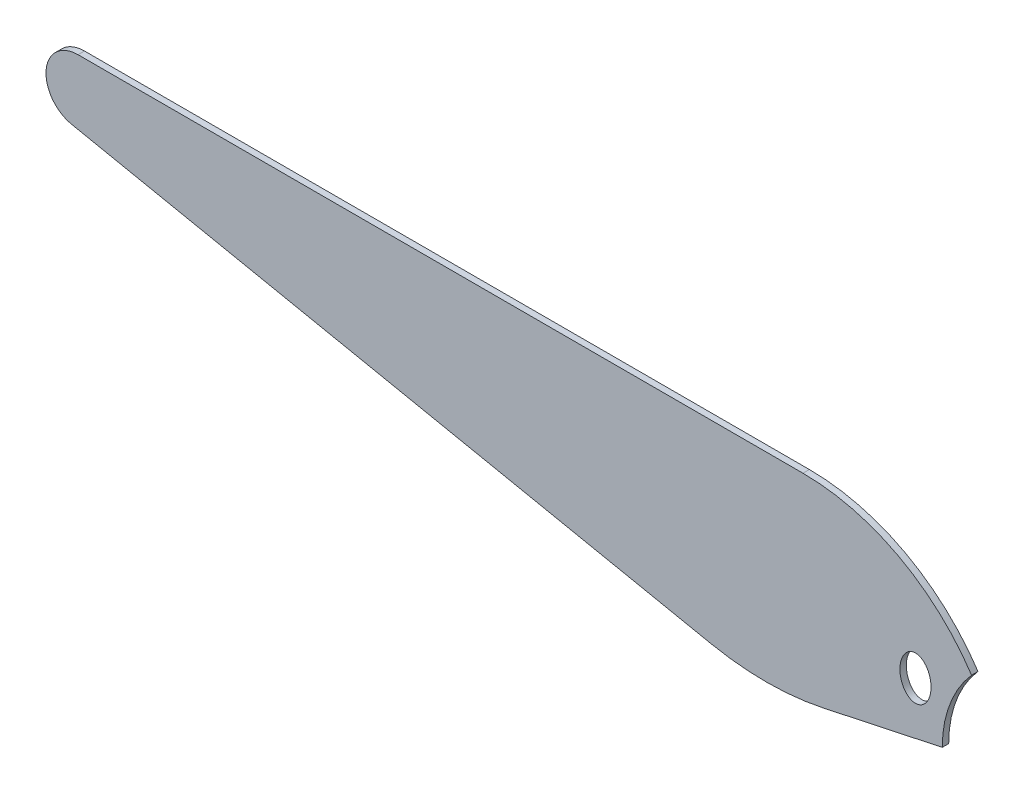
ISO-10303-21;
HEADER;
FILE_DESCRIPTION(('STEP AP214'),'2;1');
FILE_NAME('part.step','',(''),(''),'','','');
FILE_SCHEMA(('AUTOMOTIVE_DESIGN { 1 0 10303 214 1 1 1 1 }'));
ENDSEC;
DATA;
#1=APPLICATION_CONTEXT('core data for automotive mechanical design processes');
#2=APPLICATION_PROTOCOL_DEFINITION('international standard','automotive_design',2000,#1);
#3=PRODUCT_CONTEXT('',#1,'mechanical');
#4=PRODUCT('Part','Part','',(#3));
#5=PRODUCT_RELATED_PRODUCT_CATEGORY('part','',(#4));
#6=PRODUCT_DEFINITION_FORMATION('','',#4);
#7=PRODUCT_DEFINITION_CONTEXT('part definition',#1,'design');
#8=PRODUCT_DEFINITION('design','',#6,#7);
#9=PRODUCT_DEFINITION_SHAPE('','',#8);
#10=(LENGTH_UNIT() NAMED_UNIT(*) SI_UNIT(.MILLI.,.METRE.));
#11=(NAMED_UNIT(*) PLANE_ANGLE_UNIT() SI_UNIT($,.RADIAN.));
#12=(NAMED_UNIT(*) SI_UNIT($,.STERADIAN.) SOLID_ANGLE_UNIT());
#13=UNCERTAINTY_MEASURE_WITH_UNIT(LENGTH_MEASURE(1.E-05),#10,'distance_accuracy_value','');
#14=(GEOMETRIC_REPRESENTATION_CONTEXT(3) GLOBAL_UNCERTAINTY_ASSIGNED_CONTEXT((#13)) GLOBAL_UNIT_ASSIGNED_CONTEXT((#10,
#11,#12)) REPRESENTATION_CONTEXT('',''));
#15=CARTESIAN_POINT('',(0.,0.,0.));
#16=DIRECTION('',(0.,0.,1.));
#17=DIRECTION('',(1.,0.,0.));
#18=AXIS2_PLACEMENT_3D('',#15,#16,#17);
#19=CARTESIAN_POINT('',(0.,0.,1.));
#20=DIRECTION('',(0.,0.,-1.));
#21=DIRECTION('',(-1.,0.,0.));
#22=AXIS2_PLACEMENT_3D('',#19,#20,#21);
#23=CYLINDRICAL_SURFACE('',#22,5.);
#24=CARTESIAN_POINT('',(0.,0.,0.));
#25=DIRECTION('',(0.,0.,1.));
#26=DIRECTION('',(1.,0.,0.));
#27=AXIS2_PLACEMENT_3D('',#24,#25,#26);
#28=CIRCLE('',#27,5.);
#29=CARTESIAN_POINT('',(0.,5.,0.));
#30=VERTEX_POINT('',#29);
#31=CARTESIAN_POINT('',(-0.996839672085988,-4.89962352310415,0.));
#32=VERTEX_POINT('',#31);
#33=EDGE_CURVE('E121',#30,#32,#28,.T.);
#34=ORIENTED_EDGE('',*,*,#33,.T.);
#35=DIRECTION('',(0.,0.,-1.));
#36=VECTOR('',#35,1.);
#37=CARTESIAN_POINT('',(-0.996839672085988,-4.89962352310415,1.));
#38=LINE('',#37,#36);
#39=CARTESIAN_POINT('',(-0.996839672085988,-4.89962352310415,1.));
#40=VERTEX_POINT('',#39);
#41=EDGE_CURVE('E11',#40,#32,#38,.T.);
#42=ORIENTED_EDGE('',*,*,#41,.F.);
#43=CARTESIAN_POINT('',(0.,0.,1.));
#44=DIRECTION('',(0.,0.,1.));
#45=DIRECTION('',(1.,0.,0.));
#46=AXIS2_PLACEMENT_3D('',#43,#44,#45);
#47=CIRCLE('',#46,5.);
#48=CARTESIAN_POINT('',(0.,5.,1.));
#49=VERTEX_POINT('',#48);
#50=EDGE_CURVE('E134',#49,#40,#47,.T.);
#51=ORIENTED_EDGE('',*,*,#50,.F.);
#52=DIRECTION('',(0.,0.,-1.));
#53=VECTOR('',#52,1.);
#54=CARTESIAN_POINT('',(0.,5.,1.));
#55=LINE('',#54,#53);
#56=EDGE_CURVE('E117',#49,#30,#55,.T.);
#57=ORIENTED_EDGE('',*,*,#56,.T.);
#58=EDGE_LOOP('',(#34,#42,#51,#57));
#59=FACE_BOUND('',#58,.T.);
#60=ADVANCED_FACE('F31',(#59),#23,.T.);
#61=CARTESIAN_POINT('',(-0.996839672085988,-4.89962352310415,1.));
#62=DIRECTION('',(0.199367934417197,0.97992470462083,0.));
#63=DIRECTION('',(-0.97992470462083,0.199367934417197,0.));
#64=AXIS2_PLACEMENT_3D('',#61,#62,#63);
#65=PLANE('',#64);
#66=DIRECTION('',(0.97992470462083,-0.199367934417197,0.));
#67=VECTOR('',#66,1.);
#68=CARTESIAN_POINT('',(-0.996839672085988,-4.89962352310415,0.));
#69=LINE('',#68,#67);
#70=CARTESIAN_POINT('',(98.6165084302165,-25.166188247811,0.));
#71=VERTEX_POINT('',#70);
#72=EDGE_CURVE('E124',#32,#71,#69,.T.);
#73=ORIENTED_EDGE('',*,*,#72,.T.);
#74=DIRECTION('',(0.,0.,-1.));
#75=VECTOR('',#74,1.);
#76=CARTESIAN_POINT('',(98.6165084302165,-25.166188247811,1.));
#77=LINE('',#76,#75);
#78=CARTESIAN_POINT('',(98.6165084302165,-25.166188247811,1.));
#79=VERTEX_POINT('',#78);
#80=EDGE_CURVE('E39',#79,#71,#77,.T.);
#81=ORIENTED_EDGE('',*,*,#80,.F.);
#82=DIRECTION('',(0.97992470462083,-0.199367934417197,0.));
#83=VECTOR('',#82,1.);
#84=CARTESIAN_POINT('',(-0.996839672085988,-4.89962352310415,1.));
#85=LINE('',#84,#83);
#86=EDGE_CURVE('E87',#40,#79,#85,.T.);
#87=ORIENTED_EDGE('',*,*,#86,.F.);
#88=ORIENTED_EDGE('',*,*,#41,.T.);
#89=EDGE_LOOP('',(#73,#81,#87,#88));
#90=FACE_BOUND('',#89,.T.);
#91=ADVANCED_FACE('F183',(#90),#65,.F.);
#92=CARTESIAN_POINT('',(107.180634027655,16.9278338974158,1.));
#93=DIRECTION('',(0.,0.,-1.));
#94=DIRECTION('',(-1.,0.,0.));
#95=AXIS2_PLACEMENT_3D('',#92,#93,#94);
#96=CYLINDRICAL_SURFACE('',#95,42.9563842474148);
#97=CARTESIAN_POINT('',(107.180634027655,16.9278338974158,0.));
#98=DIRECTION('',(0.,0.,1.));
#99=DIRECTION('',(1.,0.,0.));
#100=AXIS2_PLACEMENT_3D('',#97,#98,#99);
#101=CIRCLE('',#100,42.9563842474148);
#102=CARTESIAN_POINT('',(116.145661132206,-25.0826319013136,0.));
#103=VERTEX_POINT('',#102);
#104=EDGE_CURVE('E127',#71,#103,#101,.T.);
#105=ORIENTED_EDGE('',*,*,#104,.T.);
#106=DIRECTION('',(0.,0.,-1.));
#107=VECTOR('',#106,1.);
#108=CARTESIAN_POINT('',(116.145661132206,-25.0826319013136,1.));
#109=LINE('',#108,#107);
#110=CARTESIAN_POINT('',(116.145661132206,-25.0826319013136,1.));
#111=VERTEX_POINT('',#110);
#112=EDGE_CURVE('E138',#111,#103,#109,.T.);
#113=ORIENTED_EDGE('',*,*,#112,.F.);
#114=CARTESIAN_POINT('',(107.180634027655,16.9278338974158,1.));
#115=DIRECTION('',(0.,0.,1.));
#116=DIRECTION('',(1.,0.,0.));
#117=AXIS2_PLACEMENT_3D('',#114,#115,#116);
#118=CIRCLE('',#117,42.9563842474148);
#119=EDGE_CURVE('E146',#79,#111,#118,.T.);
#120=ORIENTED_EDGE('',*,*,#119,.F.);
#121=ORIENTED_EDGE('',*,*,#80,.T.);
#122=EDGE_LOOP('',(#105,#113,#120,#121));
#123=FACE_BOUND('',#122,.T.);
#124=ADVANCED_FACE('F144',(#123),#96,.T.);
#125=CARTESIAN_POINT('',(134.63566517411,-21.1368678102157,1.));
#126=DIRECTION('',(-0.208700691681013,0.977979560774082,0.));
#127=DIRECTION('',(-0.977979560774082,-0.208700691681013,0.));
#128=AXIS2_PLACEMENT_3D('',#125,#126,#127);
#129=PLANE('',#128);
#130=DIRECTION('',(0.977979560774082,0.208700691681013,0.));
#131=VECTOR('',#130,1.);
#132=CARTESIAN_POINT('',(134.63566517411,-21.1368678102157,0.));
#133=LINE('',#132,#131);
#134=CARTESIAN_POINT('',(134.63566517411,-21.1368678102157,0.));
#135=VERTEX_POINT('',#134);
#136=EDGE_CURVE('E129',#103,#135,#133,.T.);
#137=ORIENTED_EDGE('',*,*,#136,.T.);
#138=DIRECTION('',(0.,0.,-1.));
#139=VECTOR('',#138,1.);
#140=CARTESIAN_POINT('',(134.63566517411,-21.1368678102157,1.));
#141=LINE('',#140,#139);
#142=CARTESIAN_POINT('',(134.63566517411,-21.1368678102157,1.));
#143=VERTEX_POINT('',#142);
#144=EDGE_CURVE('E112',#143,#135,#141,.T.);
#145=ORIENTED_EDGE('',*,*,#144,.F.);
#146=DIRECTION('',(0.977979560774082,0.208700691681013,0.));
#147=VECTOR('',#146,1.);
#148=CARTESIAN_POINT('',(134.63566517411,-21.1368678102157,1.));
#149=LINE('',#148,#147);
#150=EDGE_CURVE('E103',#111,#143,#149,.T.);
#151=ORIENTED_EDGE('',*,*,#150,.F.);
#152=ORIENTED_EDGE('',*,*,#112,.T.);
#153=EDGE_LOOP('',(#137,#145,#151,#152));
#154=FACE_BOUND('',#153,.T.);
#155=ADVANCED_FACE('F152',(#154),#129,.F.);
#156=CARTESIAN_POINT('',(152.735144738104,-21.1357524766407,1.));
#157=DIRECTION('',(0.,0.,-1.));
#158=DIRECTION('',(-1.,0.,0.));
#159=AXIS2_PLACEMENT_3D('',#156,#157,#158);
#160=CYLINDRICAL_SURFACE('',#159,18.0994795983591);
#161=CARTESIAN_POINT('',(152.735144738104,-21.1357524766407,0.));
#162=DIRECTION('',(0.,0.,-1.));
#163=DIRECTION('',(1.,0.,0.));
#164=AXIS2_PLACEMENT_3D('',#161,#162,#163);
#165=CIRCLE('',#164,18.0994795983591);
#166=CARTESIAN_POINT('',(139.202026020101,-9.11718935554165,0.));
#167=VERTEX_POINT('',#166);
#168=EDGE_CURVE('E111',#135,#167,#165,.T.);
#169=ORIENTED_EDGE('',*,*,#168,.T.);
#170=DIRECTION('',(0.,0.,-1.));
#171=VECTOR('',#170,1.);
#172=CARTESIAN_POINT('',(139.202026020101,-9.11718935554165,1.));
#173=LINE('',#172,#171);
#174=CARTESIAN_POINT('',(139.202026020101,-9.11718935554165,1.));
#175=VERTEX_POINT('',#174);
#176=EDGE_CURVE('E108',#175,#167,#173,.T.);
#177=ORIENTED_EDGE('',*,*,#176,.F.);
#178=CARTESIAN_POINT('',(152.735144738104,-21.1357524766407,1.));
#179=DIRECTION('',(0.,0.,-1.));
#180=DIRECTION('',(1.,0.,0.));
#181=AXIS2_PLACEMENT_3D('',#178,#179,#180);
#182=CIRCLE('',#181,18.0994795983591);
#183=EDGE_CURVE('E97',#143,#175,#182,.T.);
#184=ORIENTED_EDGE('',*,*,#183,.F.);
#185=ORIENTED_EDGE('',*,*,#144,.T.);
#186=EDGE_LOOP('',(#169,#177,#184,#185));
#187=FACE_BOUND('',#186,.T.);
#188=ADVANCED_FACE('F109',(#187),#160,.F.);
#189=CARTESIAN_POINT('',(112.932501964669,-26.5,1.));
#190=DIRECTION('',(0.,0.,-1.));
#191=DIRECTION('',(-1.,0.,0.));
#192=AXIS2_PLACEMENT_3D('',#189,#190,#191);
#193=CYLINDRICAL_SURFACE('',#192,31.5);
#194=CARTESIAN_POINT('',(112.932501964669,-26.5,0.));
#195=DIRECTION('',(0.,0.,1.));
#196=DIRECTION('',(-1.,0.,0.));
#197=AXIS2_PLACEMENT_3D('',#194,#195,#196);
#198=CIRCLE('',#197,31.5);
#199=CARTESIAN_POINT('',(112.932501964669,5.,0.));
#200=VERTEX_POINT('',#199);
#201=EDGE_CURVE('E73',#167,#200,#198,.T.);
#202=ORIENTED_EDGE('',*,*,#201,.T.);
#203=DIRECTION('',(0.,0.,-1.));
#204=VECTOR('',#203,1.);
#205=CARTESIAN_POINT('',(112.932501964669,5.,1.));
#206=LINE('',#205,#204);
#207=CARTESIAN_POINT('',(112.932501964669,5.,1.));
#208=VERTEX_POINT('',#207);
#209=EDGE_CURVE('E113',#208,#200,#206,.T.);
#210=ORIENTED_EDGE('',*,*,#209,.F.);
#211=CARTESIAN_POINT('',(112.932501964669,-26.5,1.));
#212=DIRECTION('',(0.,0.,1.));
#213=DIRECTION('',(-1.,0.,0.));
#214=AXIS2_PLACEMENT_3D('',#211,#212,#213);
#215=CIRCLE('',#214,31.5);
#216=EDGE_CURVE('E101',#175,#208,#215,.T.);
#217=ORIENTED_EDGE('',*,*,#216,.F.);
#218=ORIENTED_EDGE('',*,*,#176,.T.);
#219=EDGE_LOOP('',(#202,#210,#217,#218));
#220=FACE_BOUND('',#219,.T.);
#221=ADVANCED_FACE('F115',(#220),#193,.T.);
#222=CARTESIAN_POINT('',(0.,5.,1.));
#223=DIRECTION('',(0.,-1.,0.));
#224=DIRECTION('',(1.,0.,0.));
#225=AXIS2_PLACEMENT_3D('',#222,#223,#224);
#226=PLANE('',#225);
#227=DIRECTION('',(-1.,0.,0.));
#228=VECTOR('',#227,1.);
#229=CARTESIAN_POINT('',(0.,5.,0.));
#230=LINE('',#229,#228);
#231=EDGE_CURVE('E79',#200,#30,#230,.T.);
#232=ORIENTED_EDGE('',*,*,#231,.T.);
#233=ORIENTED_EDGE('',*,*,#56,.F.);
#234=DIRECTION('',(-1.,0.,0.));
#235=VECTOR('',#234,1.);
#236=CARTESIAN_POINT('',(0.,5.,1.));
#237=LINE('',#236,#235);
#238=EDGE_CURVE('E47',#208,#49,#237,.T.);
#239=ORIENTED_EDGE('',*,*,#238,.F.);
#240=ORIENTED_EDGE('',*,*,#209,.T.);
#241=EDGE_LOOP('',(#232,#233,#239,#240));
#242=FACE_BOUND('',#241,.T.);
#243=ADVANCED_FACE('F169',(#242),#226,.F.);
#244=CARTESIAN_POINT('',(0.,0.,1.));
#245=DIRECTION('',(0.,0.,1.));
#246=DIRECTION('',(1.,0.,0.));
#247=AXIS2_PLACEMENT_3D('',#244,#245,#246);
#248=PLANE('',#247);
#249=CARTESIAN_POINT('',(130.460343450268,-13.8857065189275,1.));
#250=DIRECTION('',(0.,0.,1.));
#251=DIRECTION('',(0.,1.,0.));
#252=AXIS2_PLACEMENT_3D('',#249,#250,#251);
#253=ELLIPSE('',#252,3.39459379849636,2.42131118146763);
#254=CARTESIAN_POINT('',(130.460343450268,-10.4911127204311,1.));
#255=VERTEX_POINT('',#254);
#256=EDGE_CURVE('E157',#255,#255,#253,.T.);
#257=ORIENTED_EDGE('',*,*,#256,.F.);
#258=EDGE_LOOP('',(#257));
#259=FACE_BOUND('',#258,.T.);
#260=ORIENTED_EDGE('',*,*,#50,.T.);
#261=ORIENTED_EDGE('',*,*,#86,.T.);
#262=ORIENTED_EDGE('',*,*,#119,.T.);
#263=ORIENTED_EDGE('',*,*,#150,.T.);
#264=ORIENTED_EDGE('',*,*,#183,.T.);
#265=ORIENTED_EDGE('',*,*,#216,.T.);
#266=ORIENTED_EDGE('',*,*,#238,.T.);
#267=EDGE_LOOP('',(#260,#261,#262,#263,#264,#265,#266));
#268=FACE_BOUND('',#267,.T.);
#269=ADVANCED_FACE('F99',(#259,#268),#248,.T.);
#270=CARTESIAN_POINT('',(0.,0.,0.));
#271=DIRECTION('',(0.,0.,1.));
#272=DIRECTION('',(1.,0.,0.));
#273=AXIS2_PLACEMENT_3D('',#270,#271,#272);
#274=PLANE('',#273);
#275=CARTESIAN_POINT('',(130.460343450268,-13.8857065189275,0.));
#276=DIRECTION('',(0.,0.,1.));
#277=DIRECTION('',(0.,1.,0.));
#278=AXIS2_PLACEMENT_3D('',#275,#276,#277);
#279=ELLIPSE('',#278,3.39459379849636,2.42131118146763);
#280=CARTESIAN_POINT('',(130.460343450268,-10.4911127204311,0.));
#281=VERTEX_POINT('',#280);
#282=EDGE_CURVE('E125',#281,#281,#279,.T.);
#283=ORIENTED_EDGE('',*,*,#282,.T.);
#284=EDGE_LOOP('',(#283));
#285=FACE_BOUND('',#284,.T.);
#286=ORIENTED_EDGE('',*,*,#33,.F.);
#287=ORIENTED_EDGE('',*,*,#231,.F.);
#288=ORIENTED_EDGE('',*,*,#201,.F.);
#289=ORIENTED_EDGE('',*,*,#168,.F.);
#290=ORIENTED_EDGE('',*,*,#136,.F.);
#291=ORIENTED_EDGE('',*,*,#104,.F.);
#292=ORIENTED_EDGE('',*,*,#72,.F.);
#293=EDGE_LOOP('',(#286,#287,#288,#289,#290,#291,#292));
#294=FACE_BOUND('',#293,.T.);
#295=ADVANCED_FACE('F150',(#285,#294),#274,.F.);
#296=DIRECTION('',(0.,0.,1.));
#297=VECTOR('',#296,1.);
#298=SURFACE_OF_LINEAR_EXTRUSION('',#279,#297);
#299=ORIENTED_EDGE('',*,*,#282,.F.);
#300=EDGE_LOOP('',(#299));
#301=FACE_BOUND('',#300,.T.);
#302=ORIENTED_EDGE('',*,*,#256,.T.);
#303=EDGE_LOOP('',(#302));
#304=FACE_BOUND('',#303,.T.);
#305=ADVANCED_FACE('F163',(#301,#304),#298,.F.);
#306=CLOSED_SHELL('',(#60,#91,#124,#155,#188,#221,#243,#269,#295,#305));
#307=MANIFOLD_SOLID_BREP('B2',#306);
#308=ADVANCED_BREP_SHAPE_REPRESENTATION('',(#18,#307),#14);
#309=SHAPE_DEFINITION_REPRESENTATION(#9,#308);
ENDSEC;
END-ISO-10303-21;
